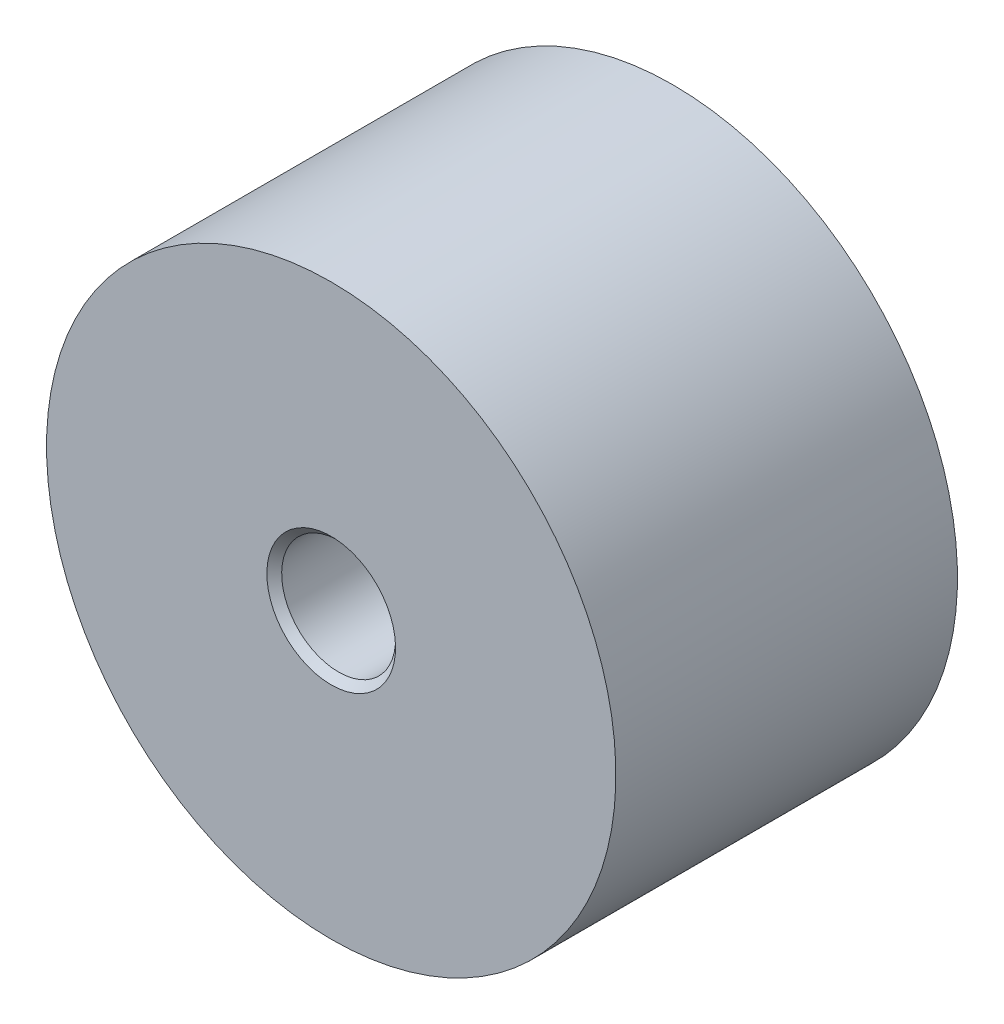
ISO-10303-21;
HEADER;
FILE_DESCRIPTION(('STEP AP214'),'2;1');
FILE_NAME('part.step','',(''),(''),'','','');
FILE_SCHEMA(('AUTOMOTIVE_DESIGN { 1 0 10303 214 1 1 1 1 }'));
ENDSEC;
DATA;
#1=APPLICATION_CONTEXT('core data for automotive mechanical design processes');
#2=APPLICATION_PROTOCOL_DEFINITION('international standard','automotive_design',2000,#1);
#3=PRODUCT_CONTEXT('',#1,'mechanical');
#4=PRODUCT('Part','Part','',(#3));
#5=PRODUCT_RELATED_PRODUCT_CATEGORY('part','',(#4));
#6=PRODUCT_DEFINITION_FORMATION('','',#4);
#7=PRODUCT_DEFINITION_CONTEXT('part definition',#1,'design');
#8=PRODUCT_DEFINITION('design','',#6,#7);
#9=PRODUCT_DEFINITION_SHAPE('','',#8);
#10=(LENGTH_UNIT() NAMED_UNIT(*) SI_UNIT(.MILLI.,.METRE.));
#11=(NAMED_UNIT(*) PLANE_ANGLE_UNIT() SI_UNIT($,.RADIAN.));
#12=(NAMED_UNIT(*) SI_UNIT($,.STERADIAN.) SOLID_ANGLE_UNIT());
#13=UNCERTAINTY_MEASURE_WITH_UNIT(LENGTH_MEASURE(1.E-05),#10,'distance_accuracy_value','');
#14=(GEOMETRIC_REPRESENTATION_CONTEXT(3) GLOBAL_UNCERTAINTY_ASSIGNED_CONTEXT((#13)) GLOBAL_UNIT_ASSIGNED_CONTEXT((#10,
#11,#12)) REPRESENTATION_CONTEXT('',''));
#15=CARTESIAN_POINT('',(0.,0.,0.));
#16=DIRECTION('',(0.,0.,1.));
#17=DIRECTION('',(1.,0.,0.));
#18=AXIS2_PLACEMENT_3D('',#15,#16,#17);
#19=CARTESIAN_POINT('',(23.333333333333,0.,30.));
#20=DIRECTION('',(0.,0.,1.));
#21=DIRECTION('',(0.,-1.,0.));
#22=AXIS2_PLACEMENT_3D('',#19,#20,#21);
#23=PLANE('',#22);
#24=CARTESIAN_POINT('',(0.,0.,30.));
#25=DIRECTION('',(0.,0.,1.));
#26=DIRECTION('',(0.,-1.,0.));
#27=AXIS2_PLACEMENT_3D('',#24,#25,#26);
#28=CIRCLE('',#27,5.65);
#29=CARTESIAN_POINT('',(0.,-5.65,30.));
#30=VERTEX_POINT('',#29);
#31=EDGE_CURVE('E8',#30,#30,#28,.F.);
#32=ORIENTED_EDGE('',*,*,#31,.T.);
#33=EDGE_LOOP('',(#32));
#34=FACE_BOUND('',#33,.T.);
#35=CARTESIAN_POINT('',(0.,0.,30.));
#36=DIRECTION('',(0.,0.,1.));
#37=DIRECTION('',(0.,-1.,0.));
#38=AXIS2_PLACEMENT_3D('',#35,#36,#37);
#39=CIRCLE('',#38,25.);
#40=CARTESIAN_POINT('',(0.,-25.,30.));
#41=VERTEX_POINT('',#40);
#42=EDGE_CURVE('E32',#41,#41,#39,.T.);
#43=ORIENTED_EDGE('',*,*,#42,.T.);
#44=EDGE_LOOP('',(#43));
#45=FACE_BOUND('',#44,.T.);
#46=ADVANCED_FACE('F12',(#34,#45),#23,.T.);
#47=CARTESIAN_POINT('',(0.,0.,1.));
#48=DIRECTION('',(0.,0.,1.));
#49=DIRECTION('',(0.,-1.,0.));
#50=AXIS2_PLACEMENT_3D('',#47,#48,#49);
#51=CYLINDRICAL_SURFACE('',#50,25.);
#52=CARTESIAN_POINT('',(0.,0.,0.));
#53=DIRECTION('',(0.,0.,1.));
#54=DIRECTION('',(0.,-1.,0.));
#55=AXIS2_PLACEMENT_3D('',#52,#53,#54);
#56=CIRCLE('',#55,25.);
#57=CARTESIAN_POINT('',(0.,-25.,0.));
#58=VERTEX_POINT('',#57);
#59=EDGE_CURVE('E35',#58,#58,#56,.T.);
#60=ORIENTED_EDGE('',*,*,#59,.T.);
#61=EDGE_LOOP('',(#60));
#62=FACE_BOUND('',#61,.T.);
#63=ORIENTED_EDGE('',*,*,#42,.F.);
#64=EDGE_LOOP('',(#63));
#65=FACE_BOUND('',#64,.T.);
#66=ADVANCED_FACE('F63',(#62,#65),#51,.T.);
#67=CARTESIAN_POINT('',(25.,0.,0.));
#68=DIRECTION('',(0.,0.,-1.));
#69=DIRECTION('',(0.,1.,0.));
#70=AXIS2_PLACEMENT_3D('',#67,#68,#69);
#71=PLANE('',#70);
#72=CARTESIAN_POINT('',(0.,0.,0.));
#73=DIRECTION('',(0.,0.,-1.));
#74=DIRECTION('',(0.,1.,0.));
#75=AXIS2_PLACEMENT_3D('',#72,#73,#74);
#76=CIRCLE('',#75,5.65);
#77=CARTESIAN_POINT('',(0.,5.65,0.));
#78=VERTEX_POINT('',#77);
#79=EDGE_CURVE('E23',#78,#78,#76,.F.);
#80=ORIENTED_EDGE('',*,*,#79,.T.);
#81=EDGE_LOOP('',(#80));
#82=FACE_BOUND('',#81,.T.);
#83=ORIENTED_EDGE('',*,*,#59,.F.);
#84=EDGE_LOOP('',(#83));
#85=FACE_BOUND('',#84,.T.);
#86=ADVANCED_FACE('F68',(#82,#85),#71,.T.);
#87=CARTESIAN_POINT('',(0.,0.,0.));
#88=DIRECTION('',(0.,0.,1.));
#89=DIRECTION('',(0.,-1.,0.));
#90=AXIS2_PLACEMENT_3D('',#87,#88,#89);
#91=CYLINDRICAL_SURFACE('',#90,5.);
#92=CARTESIAN_POINT('',(0.,0.,0.65));
#93=DIRECTION('',(0.,0.,-1.));
#94=DIRECTION('',(0.,1.,0.));
#95=AXIS2_PLACEMENT_3D('',#92,#93,#94);
#96=CIRCLE('',#95,5.);
#97=CARTESIAN_POINT('',(0.,5.,0.65));
#98=VERTEX_POINT('',#97);
#99=EDGE_CURVE('E27',#98,#98,#96,.T.);
#100=ORIENTED_EDGE('',*,*,#99,.T.);
#101=EDGE_LOOP('',(#100));
#102=FACE_BOUND('',#101,.T.);
#103=CARTESIAN_POINT('',(0.,0.,10.));
#104=DIRECTION('',(0.,0.,-1.));
#105=DIRECTION('',(0.,1.,0.));
#106=AXIS2_PLACEMENT_3D('',#103,#104,#105);
#107=CIRCLE('',#106,5.);
#108=CARTESIAN_POINT('',(0.,5.,10.));
#109=VERTEX_POINT('',#108);
#110=EDGE_CURVE('E38',#109,#109,#107,.T.);
#111=ORIENTED_EDGE('',*,*,#110,.F.);
#112=EDGE_LOOP('',(#111));
#113=FACE_BOUND('',#112,.T.);
#114=ADVANCED_FACE('F58',(#102,#113),#91,.F.);
#115=CARTESIAN_POINT('',(0.,0.,10.));
#116=DIRECTION('',(0.,0.,-1.));
#117=DIRECTION('',(0.,1.,0.));
#118=AXIS2_PLACEMENT_3D('',#115,#116,#117);
#119=PLANE('',#118);
#120=ORIENTED_EDGE('',*,*,#110,.T.);
#121=EDGE_LOOP('',(#120));
#122=FACE_BOUND('',#121,.T.);
#123=ADVANCED_FACE('F49',(#122),#119,.T.);
#124=CARTESIAN_POINT('',(0.,0.,23.333333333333));
#125=DIRECTION('',(0.,0.,1.));
#126=DIRECTION('',(0.,-1.,0.));
#127=AXIS2_PLACEMENT_3D('',#124,#125,#126);
#128=CYLINDRICAL_SURFACE('',#127,5.);
#129=CARTESIAN_POINT('',(0.,0.,29.35));
#130=DIRECTION('',(0.,0.,1.));
#131=DIRECTION('',(0.,-1.,0.));
#132=AXIS2_PLACEMENT_3D('',#129,#130,#131);
#133=CIRCLE('',#132,5.);
#134=CARTESIAN_POINT('',(0.,-5.,29.35));
#135=VERTEX_POINT('',#134);
#136=EDGE_CURVE('E19',#135,#135,#133,.T.);
#137=ORIENTED_EDGE('',*,*,#136,.T.);
#138=EDGE_LOOP('',(#137));
#139=FACE_BOUND('',#138,.T.);
#140=CARTESIAN_POINT('',(0.,0.,20.));
#141=DIRECTION('',(0.,0.,1.));
#142=DIRECTION('',(0.,-1.,0.));
#143=AXIS2_PLACEMENT_3D('',#140,#141,#142);
#144=CIRCLE('',#143,5.);
#145=CARTESIAN_POINT('',(0.,-5.,20.));
#146=VERTEX_POINT('',#145);
#147=EDGE_CURVE('E41',#146,#146,#144,.T.);
#148=ORIENTED_EDGE('',*,*,#147,.F.);
#149=EDGE_LOOP('',(#148));
#150=FACE_BOUND('',#149,.T.);
#151=ADVANCED_FACE('F47',(#139,#150),#128,.F.);
#152=CARTESIAN_POINT('',(0.,0.,20.));
#153=DIRECTION('',(0.,0.,1.));
#154=DIRECTION('',(0.,-1.,0.));
#155=AXIS2_PLACEMENT_3D('',#152,#153,#154);
#156=PLANE('',#155);
#157=ORIENTED_EDGE('',*,*,#147,.T.);
#158=EDGE_LOOP('',(#157));
#159=FACE_BOUND('',#158,.T.);
#160=ADVANCED_FACE('F45',(#159),#156,.T.);
#161=CARTESIAN_POINT('',(0.,0.,0.65));
#162=DIRECTION('',(0.,0.,-1.));
#163=DIRECTION('',(0.,1.,0.));
#164=AXIS2_PLACEMENT_3D('',#161,#162,#163);
#165=CONICAL_SURFACE('',#164,5.,0.785398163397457);
#166=ORIENTED_EDGE('',*,*,#79,.F.);
#167=EDGE_LOOP('',(#166));
#168=FACE_BOUND('',#167,.T.);
#169=ORIENTED_EDGE('',*,*,#99,.F.);
#170=EDGE_LOOP('',(#169));
#171=FACE_BOUND('',#170,.T.);
#172=ADVANCED_FACE('F56',(#168,#171),#165,.F.);
#173=CARTESIAN_POINT('',(0.,0.,29.35));
#174=DIRECTION('',(0.,0.,1.));
#175=DIRECTION('',(0.,-1.,0.));
#176=AXIS2_PLACEMENT_3D('',#173,#174,#175);
#177=CONICAL_SURFACE('',#176,5.,0.785398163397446);
#178=ORIENTED_EDGE('',*,*,#31,.F.);
#179=EDGE_LOOP('',(#178));
#180=FACE_BOUND('',#179,.T.);
#181=ORIENTED_EDGE('',*,*,#136,.F.);
#182=EDGE_LOOP('',(#181));
#183=FACE_BOUND('',#182,.T.);
#184=ADVANCED_FACE('F14',(#180,#183),#177,.F.);
#185=CLOSED_SHELL('',(#46,#66,#86,#114,#123,#151,#160,#172,#184));
#186=MANIFOLD_SOLID_BREP('B1',#185);
#187=ADVANCED_BREP_SHAPE_REPRESENTATION('',(#18,#186),#14);
#188=SHAPE_DEFINITION_REPRESENTATION(#9,#187);
ENDSEC;
END-ISO-10303-21;
